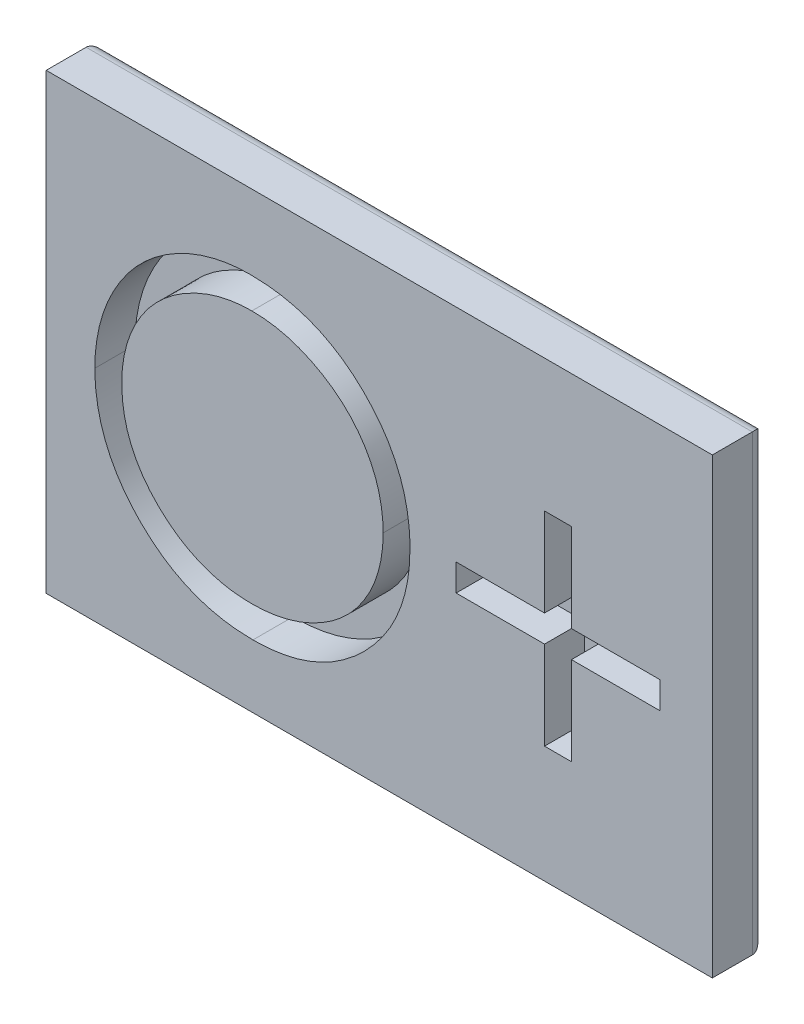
from build123d import *

# Parameters (mm, degrees)
SKETCH1_W           = 31.75
SKETCH1_H           = 21.59
BOSS_EXTRUDE1_DEPTH = 2.54
FILLET1_R           = 0.635
CUT_EXTRUDE1_DEPTH  = 1.905


with BuildPart() as part:
    # Sketch1 → Boss-Extrude1 (new body)
    with BuildSketch(Plane.XY):
        Rectangle(SKETCH1_W, SKETCH1_H)
    extrude(amount=BOSS_EXTRUDE1_DEPTH)

    # Fillet1
    fillet1_edges = [part.edges().sort_by_distance(p)[0] for p in [
        (0, -10.795, 0),
        (-15.875, 0, 0),
        (0, 10.795, 0),
        (15.875, 0, 0),
    ]]
    fillet(fillet1_edges, radius=FILLET1_R)

    # Sketch2 → Cut-Extrude1 (cut)
    # profile 1 of 2: a face of its own
    with BuildSketch(Plane.XY.offset(2.54)):
        with BuildLine():
            add(Edge.make_bspline(
                [(-6.136298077, 7.231115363), (-5.87174213, 7.22441461), (-5.352132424, 7.211253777), (-4.588465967, 7.110510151), (-3.859415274, 6.93622147), (-3.159041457, 6.704098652), (-2.495721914, 6.394450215), (-1.864463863, 6.020178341), (-1.266769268, 5.57736194), (-0.710694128, 5.06942406), (-0.201826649, 4.516769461), (0.246498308, 3.926989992), (0.6222281, 3.303651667), (0.930780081, 2.648627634), (1.172845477, 1.963399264), (1.339882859, 1.24431346), (1.446582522, 0.496029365), (1.459056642, -0.014348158), (1.465384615, -0.273256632)],
                knots=[0, 0, 0, 0, 1.065120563, 2.091984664, 3.0946048, 4.079830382, 5.057816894, 6.036188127, 7.030412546, 8.04752943, 9.064399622, 10.05169764, 11.02544977, 11.989514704, 12.962713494, 13.945757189, 14.957906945, 16, 16, 16, 16], degree=3))
            add(Edge.make_bspline(
                [(1.465384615, -0.273256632), (1.459057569, -0.530257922), (1.446586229, -1.036837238), (1.33976154, -1.780372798), (1.172226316, -2.495118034), (0.933027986, -3.179879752), (0.625946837, -3.835380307), (0.247715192, -4.459894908), (-0.197814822, -5.053628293), (-0.704844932, -5.610076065), (-1.257571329, -6.120333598), (-1.850422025, -6.564956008), (-2.470064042, -6.947551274), (-3.124471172, -7.252828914), (-3.804964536, -7.496826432), (-4.517634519, -7.66318449), (-5.259141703, -7.770491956), (-5.764800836, -7.782813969), (-6.021814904, -7.789076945)],
                knots=[0, 0, 0, 0, 1.043624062, 2.057103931, 3.04512605, 4.022047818, 4.998200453, 5.980619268, 6.982898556, 8.009068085, 9.034988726, 10.034168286, 11.015286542, 11.987931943, 12.962482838, 13.94673481, 14.956375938, 16, 16, 16, 16], degree=3))
            add(Edge.make_bspline(
                [(-6.021814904, -7.789076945), (-6.280722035, -7.782752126), (-6.791096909, -7.770284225), (-7.540321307, -7.663407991), (-8.25991224, -7.49627974), (-8.947811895, -7.257435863), (-9.604403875, -6.948755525), (-10.23097232, -6.572364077), (-10.825002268, -6.125748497), (-11.381568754, -5.618882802), (-11.890812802, -5.067093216), (-12.334784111, -4.475859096), (-12.711260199, -3.856779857), (-13.018904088, -3.208137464), (-13.262462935, -2.533067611), (-13.428625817, -1.827067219), (-13.536132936, -1.094161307), (-13.548521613, -0.595148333), (-13.554807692, -0.341946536)],
                knots=[0, 0, 0, 0, 1.053102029, 2.075944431, 3.073151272, 4.055350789, 5.033113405, 6.020478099, 7.024410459, 8.052272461, 9.079885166, 10.07527673, 11.055994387, 12.023226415, 12.992069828, 13.970394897, 14.97016774, 16, 16, 16, 16], degree=3))
            add(Edge.make_bspline(
                [(-13.554807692, -0.341946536), (-13.552625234, -0.171996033), (-13.548287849, 0.165760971), (-13.496070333, 0.667319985), (-13.420298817, 1.16081292), (-13.31170601, 1.644836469), (-13.169681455, 2.118205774), (-13.002101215, 2.584185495), (-12.797423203, 3.038053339), (-12.566044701, 3.481959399), (-12.307800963, 3.908983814), (-12.022558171, 4.312624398), (-11.720335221, 4.696268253), (-11.389014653, 5.049973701), (-11.039516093, 5.384030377), (-10.666169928, 5.693304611), (-10.271254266, 5.980585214), (-9.853069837, 6.239476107), (-9.421920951, 6.473624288), (-8.97747039, 6.674554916), (-8.525754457, 6.847009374), (-8.064657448, 6.986785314), (-7.595403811, 7.097133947), (-7.116969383, 7.172275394), (-6.629735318, 7.224626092), (-6.301484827, 7.228942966), (-6.136298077, 7.231115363)],
                knots=[0, 0, 0, 0, 1.037015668, 2.060948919, 3.074880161, 4.083647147, 5.086022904, 6.090072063, 7.104153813, 8.122640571, 9.144368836, 10.147691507, 11.138137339, 12.123020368, 13.103399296, 14.087645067, 15.080126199, 16.082011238, 17.087798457, 18.072939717, 19.057185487, 20.037253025, 21.01195951, 21.997135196, 22.992090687, 24, 24, 24, 24], degree=3))
        make_face()
        with BuildLine():
            add(Edge.make_bspline(
                [(-6.073332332, 5.765730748), (-6.208919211, 5.764077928), (-6.478796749, 5.760788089), (-6.880008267, 5.717453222), (-7.275943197, 5.655690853), (-7.666683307, 5.567592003), (-8.050593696, 5.447560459), (-8.431252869, 5.309417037), (-8.805189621, 5.141146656), (-9.171169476, 4.951030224), (-9.525969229, 4.740600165), (-9.860756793, 4.508033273), (-10.176398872, 4.258783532), (-10.472122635, 3.992269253), (-10.747059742, 3.7071332), (-11.006621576, 3.407698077), (-11.24040419, 3.085405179), (-11.454657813, 2.748994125), (-11.646387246, 2.398903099), (-11.816879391, 2.03881784), (-11.956341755, 1.665801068), (-12.070079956, 1.283899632), (-12.164376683, 0.893718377), (-12.224114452, 0.492297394), (-12.267925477, 0.081653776), (-12.271027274, -0.195857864), (-12.272596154, -0.336222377)],
                knots=[0, 0, 0, 0, 1.008559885, 2.007477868, 2.99961109, 3.989939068, 4.984837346, 5.991145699, 7.001802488, 8.033829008, 9.059044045, 10.069351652, 11.065060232, 12.050310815, 13.029377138, 14.011219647, 14.996725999, 15.989392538, 16.977580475, 17.965360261, 18.951710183, 19.937753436, 20.929683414, 21.935841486, 22.955955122, 24, 24, 24, 24], degree=3))
            add(Edge.make_bspline(
                [(-12.272596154, -0.336222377), (-12.267391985, -0.542624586), (-12.257153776, -0.948681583), (-12.167519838, -1.54372797), (-12.029453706, -2.115588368), (-11.825928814, -2.661133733), (-11.571404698, -3.18505343), (-11.256969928, -3.682699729), (-10.884437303, -4.154207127), (-10.461267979, -4.596283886), (-9.998668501, -4.999786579), (-9.507453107, -5.353967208), (-8.992884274, -5.653638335), (-8.453620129, -5.897771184), (-7.892539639, -6.091222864), (-7.30602735, -6.223805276), (-6.697990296, -6.311062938), (-6.283527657, -6.319442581), (-6.073332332, -6.323692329)],
                knots=[0, 0, 0, 0, 1.032063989, 2.030389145, 3.003944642, 3.970395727, 4.937377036, 5.913328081, 6.909231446, 7.93887556, 8.970685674, 9.976071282, 10.964166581, 11.944589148, 12.933237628, 13.927779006, 14.949070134, 16, 16, 16, 16], degree=3))
            add(Edge.make_bspline(
                [(-6.073332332, -6.323692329), (-5.932051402, -6.321751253), (-5.651848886, -6.317901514), (-5.235080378, -6.279126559), (-4.8258202, -6.216947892), (-4.424642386, -6.127423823), (-4.032002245, -6.015380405), (-3.646260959, -5.882271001), (-3.271527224, -5.716204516), (-2.903073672, -5.532720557), (-2.550391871, -5.323550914), (-2.213714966, -5.098877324), (-1.901529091, -4.849994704), (-1.60602656, -4.587440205), (-1.329960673, -4.305919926), (-1.075198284, -4.005799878), (-0.842597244, -3.685185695), (-0.62842498, -3.349284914), (-0.437367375, -2.998235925), (-0.270901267, -2.636845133), (-0.12967498, -2.266002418), (-0.015666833, -1.885172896), (0.073672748, -1.49507986), (0.135231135, -1.095200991), (0.178291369, -0.686336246), (0.181536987, -0.409796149), (0.183173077, -0.270394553)],
                knots=[0, 0, 0, 0, 1.047197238, 2.076906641, 3.100256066, 4.114471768, 5.12198147, 6.126382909, 7.136867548, 8.15857795, 9.17633901, 10.174870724, 11.156907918, 12.133735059, 13.104061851, 14.077631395, 15.04955518, 16.038496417, 17.029181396, 18.010275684, 18.986308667, 19.968651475, 20.955262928, 21.950658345, 22.966943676, 24, 24, 24, 24], degree=3))
            add(Edge.make_bspline(
                [(0.183173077, -0.270394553), (0.181535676, -0.131946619), (0.178287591, 0.14269036), (0.135251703, 0.548703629), (0.073607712, 0.945705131), (-0.015230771, 1.332136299), (-0.129735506, 1.708095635), (-0.27092593, 2.073230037), (-0.437417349, 2.428899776), (-0.628495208, 2.774225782), (-0.843280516, 3.105592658), (-1.07798023, 3.422376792), (-1.336646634, 3.71862909), (-1.611889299, 4.001663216), (-1.910583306, 4.265442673), (-2.231375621, 4.510054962), (-2.570371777, 4.741403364), (-2.929303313, 4.950105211), (-3.299733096, 5.142840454), (-3.679837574, 5.307967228), (-4.065310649, 5.448279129), (-4.455172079, 5.567955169), (-4.852703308, 5.655345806), (-5.255218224, 5.717508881), (-5.662159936, 5.760773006), (-5.935839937, 5.764072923), (-6.073332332, 5.765730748)],
                knots=[0, 0, 0, 0, 1.02996197, 2.043119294, 3.035359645, 4.018872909, 4.991431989, 5.957985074, 6.929999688, 7.912076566, 8.892894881, 9.867085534, 10.843653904, 11.817741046, 12.803660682, 13.806313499, 14.818574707, 15.856120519, 16.894564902, 17.924820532, 18.937903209, 19.946497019, 20.957711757, 21.963978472, 22.977135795, 24, 24, 24, 24], degree=3))
        make_face(mode=Mode.SUBTRACT)
    # profile 2 of 2: a face of its own
    with BuildSketch(Plane.XY.offset(2.54)):
        Polygon((7.876442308, 0.27053844), (7.876442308, 4.483519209), (9.158653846, 4.483519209), (9.158653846, 0.27053844), (13.371634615, 0.27053844), (13.371634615, -1.011673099), (9.158653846, -1.011673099), (9.158653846, -5.224653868), (7.876442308, -5.224653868), (7.876442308, -1.011673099), (3.663461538, -1.011673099), (3.663461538, 0.27053844), align=None)
    extrude(amount=-CUT_EXTRUDE1_DEPTH, mode=Mode.SUBTRACT)


solid = part.part
